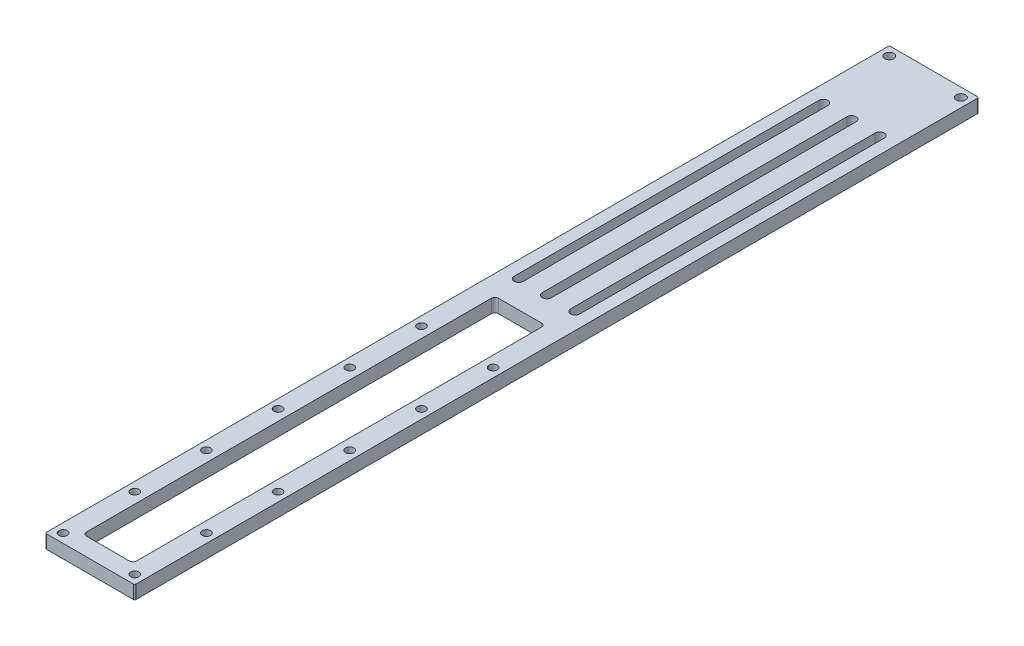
from build123d import *

# Parameters (mm, degrees)
SKETCH1_W                      = 31.75
SKETCH1_H                      = 4.7625
BOSS_EXTRUDE1_DEPTH            = 308.6608
SKETCH2_W                      = 17.78
SKETCH2_H                      = 146.05
CUT_EXTRUDE2_DEPTH             = 6.35
F_4_CLEARANCE_HOLE1_AT_2_COUNT = 2
F_4_CLEARANCE_HOLE1_AT_2_PITCH = 25.4
CUT_EXTRUDE4_DEPTH             = 8.128
LPATTERN1_COUNT                = 2
LPATTERN1_PITCH                = 10
LPATTERN2_COUNT                = 2
LPATTERN2_PITCH                = 10
F_4_CLEARANCE_HOLE2_D          = 3.2639
F_4_CLEARANCE_HOLE2_DEPTH      = 25.4
F_4_CLEARANCE_HOLE2_TIP        = 0.980574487
SKETCH9_W                      = 36.705635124
SKETCH9_H                      = 8.678632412
CUT_EXTRUDE5_DEPTH             = 9.525
FILLET1_R                      = 1.27
FILLET2_R                      = 0.508
LPATTERN3_COUNT                = 6
LPATTERN3_PITCH                = 25.4


with BuildPart() as part:
    # Sketch1 → Boss-Extrude1 (new body)
    with BuildSketch(Plane.XY):
        Rectangle(SKETCH1_W, SKETCH1_H)
    extrude(amount=BOSS_EXTRUDE1_DEPTH)

    # Sketch2 → Cut-Extrude2 (cut)
    with BuildSketch(Plane(origin=(0, 2.38125, 0), x_dir=(1, 0, 0), z_dir=(0, 1, 0))):
        with Locations((0, -219.7608)):
            Rectangle(SKETCH2_W, SKETCH2_H)
    extrude(amount=-CUT_EXTRUDE2_DEPTH, mode=Mode.SUBTRACT)

    # Sketch5 → 4 Clearance Hole1 (revolve, cut)
    with BuildSketch(Plane(origin=(12.7, 2.38125, 295.9608), x_dir=(0, 0, 1), z_dir=(1, 0, 0))):
        Polygon((0, 0), (0, 26.285187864), (1.4732, 25.4), (1.4732, 0), align=None)
    f_4_clearance_hole1 = revolve(axis=Axis((12.7, 8.73125, 295.9608), (0, -1, 0)), mode=Mode.SUBTRACT)

    # 4 Clearance Hole1 at 2: 4 Clearance Hole1 ×2
    with Locations(*[(-i * F_4_CLEARANCE_HOLE1_AT_2_PITCH, 0, 0) for i in range(1, F_4_CLEARANCE_HOLE1_AT_2_COUNT)]):
        add(f_4_clearance_hole1, mode=Mode.SUBTRACT)

    # Sketch6 → Cut-Extrude4 (cut)
    with BuildSketch(Plane.XZ.offset(2.38125)):
        with BuildLine():
            Line((1.614488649, 137.2108), (1.614488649, 29.2608))
            ThreePointArc((1.614488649, 29.2608), (0.014488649, 27.6608), (-1.585511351, 29.2608))
            Line((-1.585511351, 29.2608), (-1.585511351, 137.2108))
            ThreePointArc((-1.585511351, 137.2108), (0.014488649, 138.8108), (1.614488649, 137.2108))
        make_face()
    cut_extrude4 = extrude(amount=-CUT_EXTRUDE4_DEPTH, mode=Mode.SUBTRACT)

    # LPattern1: Cut-Extrude4 ×2
    with Locations(*[(-i * LPATTERN1_PITCH, 0, 0) for i in range(1, LPATTERN1_COUNT)]):
        add(cut_extrude4, mode=Mode.SUBTRACT)

    # LPattern2: Cut-Extrude4 ×2
    with Locations(*[(i * LPATTERN2_PITCH, 0, 0) for i in range(1, LPATTERN2_COUNT)]):
        add(cut_extrude4, mode=Mode.SUBTRACT)

    # 4 Clearance Hole2
    with Locations(Plane(origin=(0, 2.38125, 0), x_dir=(1, 0, 0), z_dir=(0, 1, 0))):
        with Locations((12.7, -306.27955), (-12.7, -306.27955), (12.7, -3.175), (-12.7, -3.175)):
            Hole(F_4_CLEARANCE_HOLE2_D / 2, depth=F_4_CLEARANCE_HOLE2_DEPTH)
            with Locations((0, 0, -(F_4_CLEARANCE_HOLE2_DEPTH + F_4_CLEARANCE_HOLE2_TIP / 2))):  # 118° drill point
                Cone(0, F_4_CLEARANCE_HOLE2_D / 2, F_4_CLEARANCE_HOLE2_TIP, mode=Mode.SUBTRACT)

    # Sketch9 → Cut-Extrude5 (cut)
    with BuildSketch(Plane.XY.offset(308.6608)):
        Rectangle(SKETCH9_W, SKETCH9_H)
    extrude(amount=-CUT_EXTRUDE5_DEPTH, mode=Mode.SUBTRACT)

    # Fillet1
    fillet1_edges = [part.edges().sort_by_distance(p)[0] for p in [
        (-8.89, 0, 292.7858),
        (-8.89, 0, 146.7358),
        (8.89, 0, 146.7358),
        (8.89, 0, 292.7858),
    ]]
    fillet(fillet1_edges, radius=FILLET1_R)

    # Fillet2
    fillet2_edges = [part.edges().sort_by_distance(p)[0] for p in [
        (15.875, 0, 299.1358),
        (-15.875, 0, 299.1358),
        (-15.875, 0, 0),
        (15.875, 0, 0),
    ]]
    fillet(fillet2_edges, radius=FILLET2_R)

    # LPattern3: 4 Clearance Hole1 ×6
    with Locations(*[(0, 0, -i * LPATTERN3_PITCH) for i in range(1, LPATTERN3_COUNT)]):
        add(f_4_clearance_hole1, mode=Mode.SUBTRACT)

    # LPattern3 copy 1 sketch → LPattern3 copy 1 (revolve, cut)
    with BuildSketch(Plane(origin=(-12.7, 2.38125, 270.5608), x_dir=(0, 0, 1), z_dir=(1, 0, 0))):
        Polygon((0, 0), (0, 26.285187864), (1.4732, 25.4), (1.4732, 0), align=None)
    revolve(axis=Axis((-12.7, 8.73125, 270.5608), (0, -1, 0)), mode=Mode.SUBTRACT)

    # LPattern3 copy 2 sketch → LPattern3 copy 2 (revolve, cut)
    with BuildSketch(Plane(origin=(-12.7, 2.38125, 245.1608), x_dir=(0, 0, 1), z_dir=(1, 0, 0))):
        Polygon((0, 0), (0, 26.285187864), (1.4732, 25.4), (1.4732, 0), align=None)
    revolve(axis=Axis((-12.7, 8.73125, 245.1608), (0, -1, 0)), mode=Mode.SUBTRACT)

    # LPattern3 copy 3 sketch → LPattern3 copy 3 (revolve, cut)
    with BuildSketch(Plane(origin=(-12.7, 2.38125, 219.7608), x_dir=(0, 0, 1), z_dir=(1, 0, 0))):
        Polygon((0, 0), (0, 26.285187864), (1.4732, 25.4), (1.4732, 0), align=None)
    revolve(axis=Axis((-12.7, 8.73125, 219.7608), (0, -1, 0)), mode=Mode.SUBTRACT)

    # LPattern3 copy 4 sketch → LPattern3 copy 4 (revolve, cut)
    with BuildSketch(Plane(origin=(-12.7, 2.38125, 194.3608), x_dir=(0, 0, 1), z_dir=(1, 0, 0))):
        Polygon((0, 0), (0, 26.285187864), (1.4732, 25.4), (1.4732, 0), align=None)
    revolve(axis=Axis((-12.7, 8.73125, 194.3608), (0, -1, 0)), mode=Mode.SUBTRACT)

    # LPattern3 copy 5 sketch → LPattern3 copy 5 (revolve, cut)
    with BuildSketch(Plane(origin=(-12.7, 2.38125, 168.9608), x_dir=(0, 0, 1), z_dir=(1, 0, 0))):
        Polygon((0, 0), (0, 26.285187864), (1.4732, 25.4), (1.4732, 0), align=None)
    revolve(axis=Axis((-12.7, 8.73125, 168.9608), (0, -1, 0)), mode=Mode.SUBTRACT)


solid = part.part
